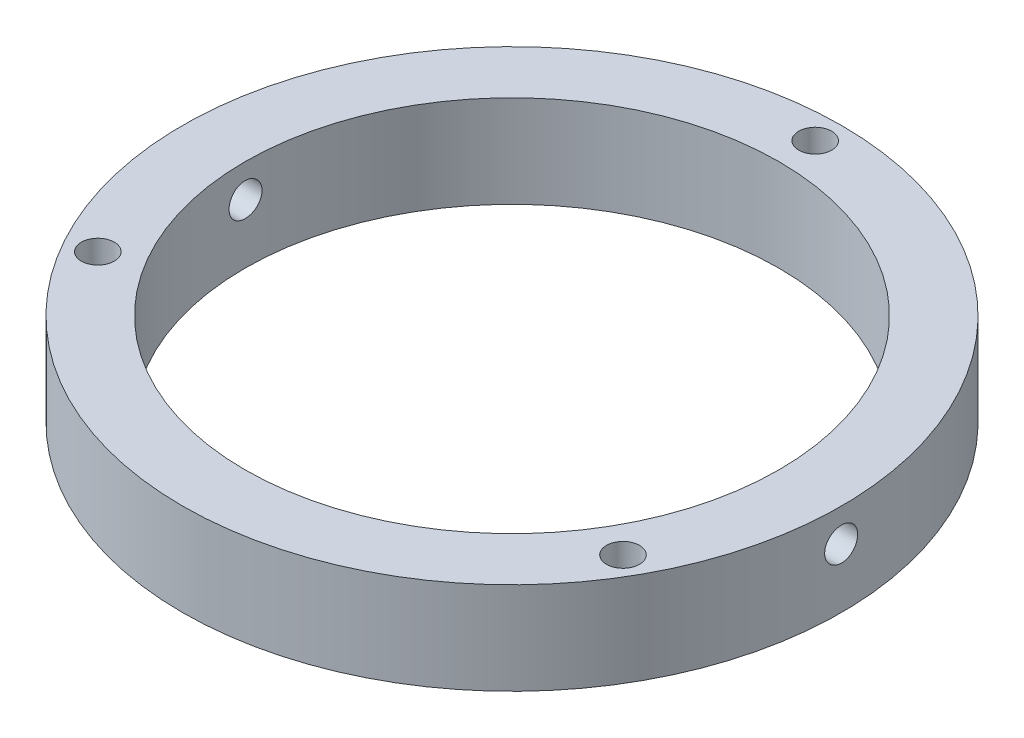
from build123d import *

# Parameters (mm, degrees)
SKETCH1_R             = 25
BOSS_EXTRUDE1_DEPTH   = 7
SKETCH6_R             = 20.25
CUT_EXTRUDE3_DEPTH    = 37.041642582
M3X0_5_TAPPED_HOLE1_D = 2.5
M3X0_5_TAPPED_HOLE2_D = 2.5


with BuildPart() as part:
    # Sketch1 → Boss-Extrude1 (new body)
    with BuildSketch(Plane(origin=(0, 0, 0), x_dir=(1, 0, 0), z_dir=(0, 1, 0))):
        with Locations(Location((0, 0, 0), (0, 0, 270))):
            Circle(SKETCH1_R)
    extrude(amount=BOSS_EXTRUDE1_DEPTH)

    # Sketch6 → Cut-Extrude3 (cut, through all)
    with BuildSketch(Plane(origin=(0, 7, 0), x_dir=(1, 0, 0), z_dir=(0, 1, 0))):
        with Locations(Location((0, 0, 0), (0, 0, 270))):
            Circle(SKETCH6_R)
    extrude(amount=-CUT_EXTRUDE3_DEPTH, mode=Mode.SUBTRACT)

    # M3x0.5 Tapped Hole1 (through all)
    with Locations(Plane(origin=(0, 7, 0), x_dir=(1, 0, 0), z_dir=(0, 1, 0))):
        with Locations((0, 23), (-19.918584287, -11.5), (19.918584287, -11.5)):
            Hole(M3X0_5_TAPPED_HOLE1_D / 2)

    # M3x0.5 Tapped Hole2 (through all)
    with Locations(Plane(origin=(25, 0, 0), x_dir=(0, 0, -1), z_dir=(1, 0, 0))):
        with Locations((0, 4.5)):
            Hole(M3X0_5_TAPPED_HOLE2_D / 2)


solid = part.part
